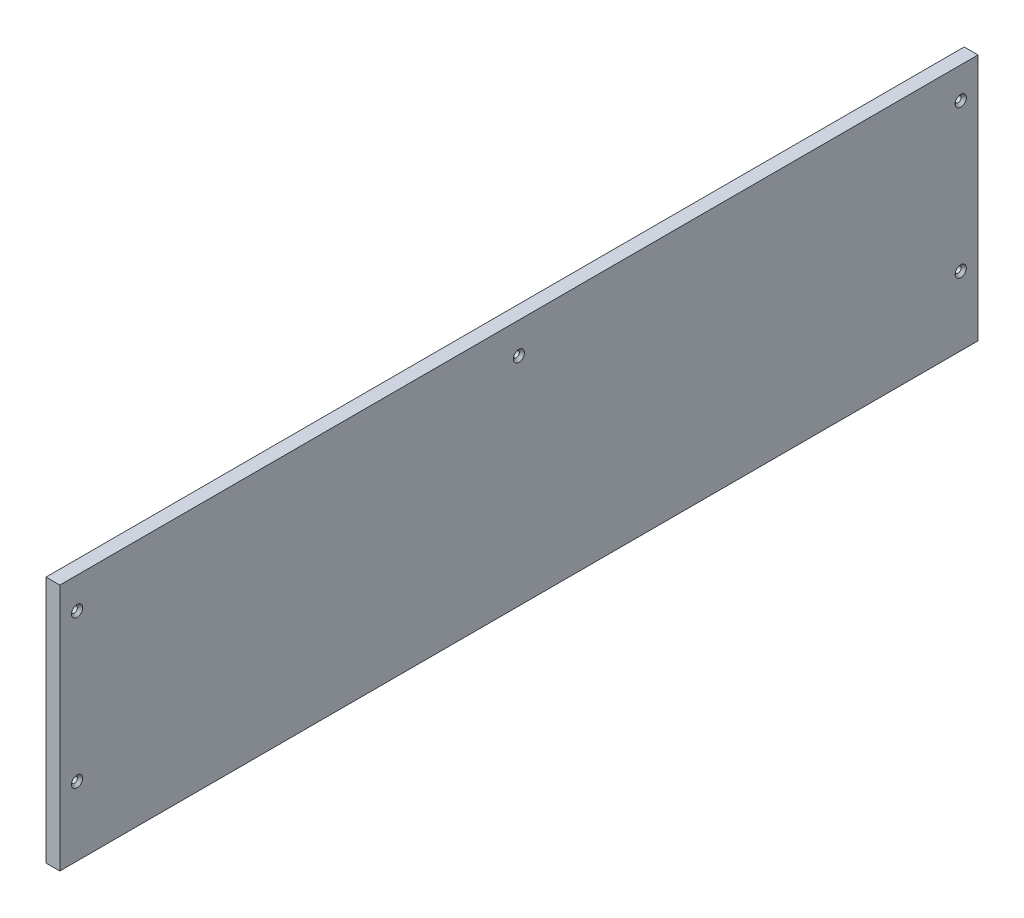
from build123d import *

# Parameters (mm, degrees)
SKIZZE1_W                        = 532
SKIZZE1_H                        = 143.5
AUFSATZ_LINEAR_AUSTRAGEN1_DEPTH  = 8
F_3_5_3_5_DURCHMESSER_BOHRUNG1_D = 3.5
FASE1_SIZE                       = 1.5


with BuildPart() as part:
    # Skizze1 → Aufsatz-Linear austragen1 (new body)
    with BuildSketch(Plane(origin=(0, 0, 0), x_dir=(0, 0, -1), z_dir=(1, 0, 0))):
        Rectangle(SKIZZE1_W, SKIZZE1_H)
    extrude(amount=AUFSATZ_LINEAR_AUSTRAGEN1_DEPTH)

    # 3.5 _3.5_ Durchmesser Bohrung1 (through all)
    with Locations(Plane.ZY):
        with Locations((-256, -31.75), (-256, 53.75), (0, 53.75), (256, 53.75), (256, -31.75)):
            Hole(F_3_5_3_5_DURCHMESSER_BOHRUNG1_D / 2)

    # Fase1
    fase1_edges = [part.edges().sort_by_distance(p)[0] for p in [
        (8, -31.75, 257.75),
        (8, 53.75, 257.75),
        (8, 53.75, 1.75),
        (8, 53.75, -254.25),
        (8, -31.75, -254.25),
    ]]
    chamfer(fase1_edges, length=FASE1_SIZE)


solid = part.part
